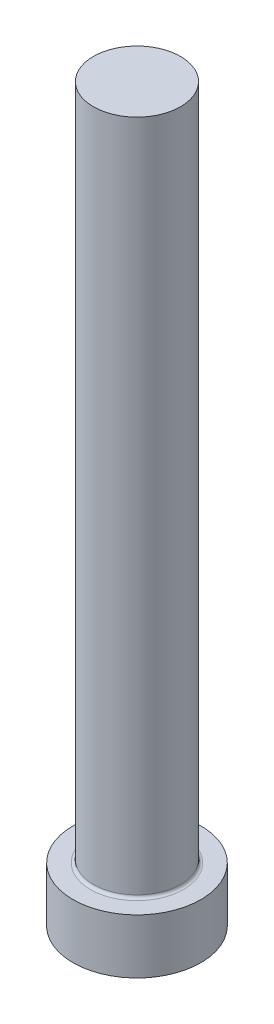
from build123d import *


with BuildPart() as part:
    # Sketch1 → Revolve3 (revolve)
    with BuildSketch(Plane.XY, mode=Mode.PRIVATE) as revolve3_sk:
        with BuildLine():
            Line((0, 0), (5.5499, 0))
            Line((5.5499, 0), (5.5499, 4.7498))
            Line((5.5499, 4.7498), (4.0386, 4.7498))
            ThreePointArc((4.0386, 4.7498), (3.858994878, 4.824194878), (3.7846, 5.0038))
            Line((3.7846, 5.0038), (3.7846, 63.5))
            Line((3.7846, 63.5), (0, 63.5))
            Line((0, 63.5), (0, 0))
        make_face()
    revolve(revolve3_sk.sketch.rotate(Axis((0, 0, 0), (0, -1, 0)), 90), axis=Axis((0, 0, 0), (0, -1, 0)))


solid = part.part
